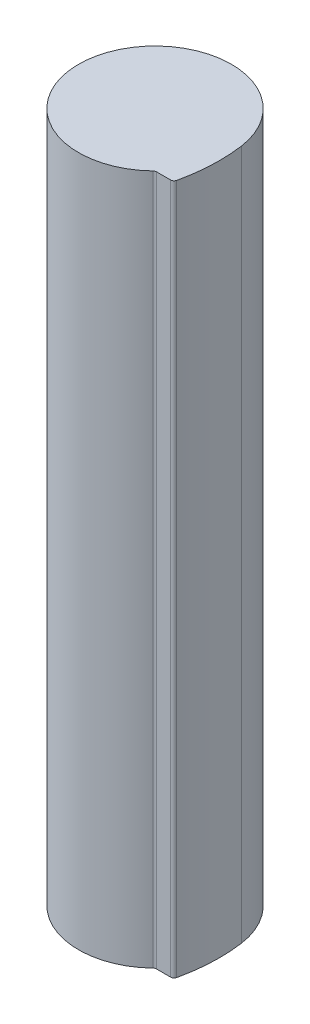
ISO-10303-21;
HEADER;
FILE_DESCRIPTION(('STEP AP214'),'2;1');
FILE_NAME('part.step','',(''),(''),'','','');
FILE_SCHEMA(('AUTOMOTIVE_DESIGN { 1 0 10303 214 1 1 1 1 }'));
ENDSEC;
DATA;
#1=APPLICATION_CONTEXT('core data for automotive mechanical design processes');
#2=APPLICATION_PROTOCOL_DEFINITION('international standard','automotive_design',2000,#1);
#3=PRODUCT_CONTEXT('',#1,'mechanical');
#4=PRODUCT('Part','Part','',(#3));
#5=PRODUCT_RELATED_PRODUCT_CATEGORY('part','',(#4));
#6=PRODUCT_DEFINITION_FORMATION('','',#4);
#7=PRODUCT_DEFINITION_CONTEXT('part definition',#1,'design');
#8=PRODUCT_DEFINITION('design','',#6,#7);
#9=PRODUCT_DEFINITION_SHAPE('','',#8);
#10=(LENGTH_UNIT() NAMED_UNIT(*) SI_UNIT(.MILLI.,.METRE.));
#11=(NAMED_UNIT(*) PLANE_ANGLE_UNIT() SI_UNIT($,.RADIAN.));
#12=(NAMED_UNIT(*) SI_UNIT($,.STERADIAN.) SOLID_ANGLE_UNIT());
#13=UNCERTAINTY_MEASURE_WITH_UNIT(LENGTH_MEASURE(1.E-05),#10,'distance_accuracy_value','');
#14=(GEOMETRIC_REPRESENTATION_CONTEXT(3) GLOBAL_UNCERTAINTY_ASSIGNED_CONTEXT((#13)) GLOBAL_UNIT_ASSIGNED_CONTEXT((#10,
#11,#12)) REPRESENTATION_CONTEXT('',''));
#15=CARTESIAN_POINT('',(0.,0.,0.));
#16=DIRECTION('',(0.,0.,1.));
#17=DIRECTION('',(1.,0.,0.));
#18=AXIS2_PLACEMENT_3D('',#15,#16,#17);
#19=CARTESIAN_POINT('',(0.,60.,0.));
#20=DIRECTION('',(0.,-1.,0.));
#21=DIRECTION('',(0.,0.,-1.));
#22=AXIS2_PLACEMENT_3D('',#19,#20,#21);
#23=CYLINDRICAL_SURFACE('',#22,6.65);
#24=CARTESIAN_POINT('',(0.,0.,0.));
#25=DIRECTION('',(0.,1.,0.));
#26=DIRECTION('',(0.,0.,1.));
#27=AXIS2_PLACEMENT_3D('',#24,#25,#26);
#28=CIRCLE('',#27,6.65);
#29=CARTESIAN_POINT('',(6.58730229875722,0.,-0.911015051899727));
#30=VERTEX_POINT('',#29);
#31=CARTESIAN_POINT('',(4.61441213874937,0.,4.78849669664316));
#32=VERTEX_POINT('',#31);
#33=EDGE_CURVE('E119',#30,#32,#28,.T.);
#34=ORIENTED_EDGE('',*,*,#33,.T.);
#35=DIRECTION('',(0.,-1.,0.));
#36=VECTOR('',#35,1.);
#37=CARTESIAN_POINT('',(4.61441213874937,60.,4.78849669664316));
#38=LINE('',#37,#36);
#39=CARTESIAN_POINT('',(4.61441213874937,60.,4.78849669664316));
#40=VERTEX_POINT('',#39);
#41=EDGE_CURVE('E55',#32,#40,#38,.F.);
#42=ORIENTED_EDGE('',*,*,#41,.T.);
#43=CARTESIAN_POINT('',(0.,60.,0.));
#44=DIRECTION('',(0.,1.,0.));
#45=DIRECTION('',(0.,0.,1.));
#46=AXIS2_PLACEMENT_3D('',#43,#44,#45);
#47=CIRCLE('',#46,6.65);
#48=CARTESIAN_POINT('',(6.58730229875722,60.,-0.911015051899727));
#49=VERTEX_POINT('',#48);
#50=EDGE_CURVE('E92',#49,#40,#47,.T.);
#51=ORIENTED_EDGE('',*,*,#50,.F.);
#52=DIRECTION('',(0.,-1.,0.));
#53=VECTOR('',#52,1.);
#54=CARTESIAN_POINT('',(6.58730229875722,60.,-0.911015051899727));
#55=LINE('',#54,#53);
#56=EDGE_CURVE('E100',#49,#30,#55,.T.);
#57=ORIENTED_EDGE('',*,*,#56,.T.);
#58=EDGE_LOOP('',(#34,#42,#51,#57));
#59=FACE_BOUND('',#58,.T.);
#60=ADVANCED_FACE('F39',(#59),#23,.T.);
#61=CARTESIAN_POINT('',(4.7,60.,4.70451910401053));
#62=DIRECTION('',(0.,0.,-1.));
#63=DIRECTION('',(-1.,0.,0.));
#64=AXIS2_PLACEMENT_3D('',#61,#62,#63);
#65=PLANE('',#64);
#66=DIRECTION('',(1.,0.,0.));
#67=VECTOR('',#66,1.);
#68=CARTESIAN_POINT('',(4.7,0.,4.70451910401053));
#69=LINE('',#68,#67);
#70=CARTESIAN_POINT('',(4.82258110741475,0.,4.70451910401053));
#71=VERTEX_POINT('',#70);
#72=CARTESIAN_POINT('',(6.06254593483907,0.,4.70451910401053));
#73=VERTEX_POINT('',#72);
#74=EDGE_CURVE('E116',#71,#73,#69,.T.);
#75=ORIENTED_EDGE('',*,*,#74,.T.);
#76=DIRECTION('',(0.,-1.,0.));
#77=VECTOR('',#76,1.);
#78=CARTESIAN_POINT('',(6.06254593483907,60.,4.70451910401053));
#79=LINE('',#78,#77);
#80=CARTESIAN_POINT('',(6.06254593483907,60.,4.70451910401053));
#81=VERTEX_POINT('',#80);
#82=EDGE_CURVE('E63',#73,#81,#79,.F.);
#83=ORIENTED_EDGE('',*,*,#82,.T.);
#84=DIRECTION('',(1.,0.,0.));
#85=VECTOR('',#84,1.);
#86=CARTESIAN_POINT('',(4.7,60.,4.70451910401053));
#87=LINE('',#86,#85);
#88=CARTESIAN_POINT('',(4.82258110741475,60.,4.70451910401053));
#89=VERTEX_POINT('',#88);
#90=EDGE_CURVE('E101',#89,#81,#87,.T.);
#91=ORIENTED_EDGE('',*,*,#90,.F.);
#92=DIRECTION('',(0.,1.,0.));
#93=VECTOR('',#92,1.);
#94=CARTESIAN_POINT('',(4.82258110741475,0.,4.70451910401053));
#95=LINE('',#94,#93);
#96=EDGE_CURVE('E129',#89,#71,#95,.F.);
#97=ORIENTED_EDGE('',*,*,#96,.T.);
#98=EDGE_LOOP('',(#75,#83,#91,#97));
#99=FACE_BOUND('',#98,.T.);
#100=ADVANCED_FACE('F144',(#99),#65,.F.);
#101=CARTESIAN_POINT('',(-8.27127431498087,60.,1.14390611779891));
#102=DIRECTION('',(0.,-1.,0.));
#103=DIRECTION('',(0.,0.,-1.));
#104=AXIS2_PLACEMENT_3D('',#101,#102,#103);
#105=CYLINDRICAL_SURFACE('',#104,15.);
#106=CARTESIAN_POINT('',(-8.27127431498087,60.,1.14390611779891));
#107=DIRECTION('',(0.,1.,0.));
#108=DIRECTION('',(0.,0.,1.));
#109=AXIS2_PLACEMENT_3D('',#106,#107,#108);
#110=CIRCLE('',#109,15.);
#111=CARTESIAN_POINT('',(6.35507287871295,60.,4.47106222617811));
#112=VERTEX_POINT('',#111);
#113=EDGE_CURVE('E89',#112,#49,#110,.T.);
#114=ORIENTED_EDGE('',*,*,#113,.F.);
#115=DIRECTION('',(0.,-1.,0.));
#116=VECTOR('',#115,1.);
#117=CARTESIAN_POINT('',(6.35507287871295,60.,4.47106222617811));
#118=LINE('',#117,#116);
#119=CARTESIAN_POINT('',(6.35507287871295,0.,4.47106222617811));
#120=VERTEX_POINT('',#119);
#121=EDGE_CURVE('E109',#112,#120,#118,.T.);
#122=ORIENTED_EDGE('',*,*,#121,.T.);
#123=CARTESIAN_POINT('',(-8.27127431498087,0.,1.14390611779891));
#124=DIRECTION('',(0.,1.,0.));
#125=DIRECTION('',(0.,0.,1.));
#126=AXIS2_PLACEMENT_3D('',#123,#124,#125);
#127=CIRCLE('',#126,15.);
#128=EDGE_CURVE('E106',#120,#30,#127,.T.);
#129=ORIENTED_EDGE('',*,*,#128,.T.);
#130=ORIENTED_EDGE('',*,*,#56,.F.);
#131=EDGE_LOOP('',(#114,#122,#129,#130));
#132=FACE_BOUND('',#131,.T.);
#133=ADVANCED_FACE('F104',(#132),#105,.T.);
#134=CARTESIAN_POINT('',(0.,60.,0.));
#135=DIRECTION('',(0.,1.,0.));
#136=DIRECTION('',(0.,0.,1.));
#137=AXIS2_PLACEMENT_3D('',#134,#135,#136);
#138=PLANE('',#137);
#139=ORIENTED_EDGE('',*,*,#90,.T.);
#140=CARTESIAN_POINT('',(6.06254593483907,60.,4.40451910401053));
#141=DIRECTION('',(0.,1.,0.));
#142=DIRECTION('',(0.,0.,1.));
#143=AXIS2_PLACEMENT_3D('',#140,#141,#142);
#144=CIRCLE('',#143,0.3);
#145=EDGE_CURVE('E95',#81,#112,#144,.T.);
#146=ORIENTED_EDGE('',*,*,#145,.T.);
#147=ORIENTED_EDGE('',*,*,#113,.T.);
#148=ORIENTED_EDGE('',*,*,#50,.T.);
#149=CARTESIAN_POINT('',(4.82258110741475,60.,5.00451910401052));
#150=DIRECTION('',(0.,1.,0.));
#151=DIRECTION('',(0.,0.,1.));
#152=AXIS2_PLACEMENT_3D('',#149,#150,#151);
#153=CIRCLE('',#152,0.3);
#154=EDGE_CURVE('E11',#40,#89,#153,.F.);
#155=ORIENTED_EDGE('',*,*,#154,.T.);
#156=EDGE_LOOP('',(#139,#146,#147,#148,#155));
#157=FACE_BOUND('',#156,.T.);
#158=ADVANCED_FACE('F91',(#157),#138,.T.);
#159=CARTESIAN_POINT('',(0.,0.,0.));
#160=DIRECTION('',(0.,1.,0.));
#161=DIRECTION('',(0.,0.,1.));
#162=AXIS2_PLACEMENT_3D('',#159,#160,#161);
#163=PLANE('',#162);
#164=ORIENTED_EDGE('',*,*,#128,.F.);
#165=CARTESIAN_POINT('',(6.06254593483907,0.,4.40451910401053));
#166=DIRECTION('',(0.,1.,0.));
#167=DIRECTION('',(0.,0.,1.));
#168=AXIS2_PLACEMENT_3D('',#165,#166,#167);
#169=CIRCLE('',#168,0.3);
#170=EDGE_CURVE('E126',#120,#73,#169,.F.);
#171=ORIENTED_EDGE('',*,*,#170,.T.);
#172=ORIENTED_EDGE('',*,*,#74,.F.);
#173=CARTESIAN_POINT('',(4.82258110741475,0.,5.00451910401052));
#174=DIRECTION('',(0.,1.,0.));
#175=DIRECTION('',(0.,0.,1.));
#176=AXIS2_PLACEMENT_3D('',#173,#174,#175);
#177=CIRCLE('',#176,0.3);
#178=EDGE_CURVE('E48',#71,#32,#177,.T.);
#179=ORIENTED_EDGE('',*,*,#178,.T.);
#180=ORIENTED_EDGE('',*,*,#33,.F.);
#181=EDGE_LOOP('',(#164,#171,#172,#179,#180));
#182=FACE_BOUND('',#181,.T.);
#183=ADVANCED_FACE('F141',(#182),#163,.F.);
#184=CARTESIAN_POINT('',(6.06254593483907,60.,4.40451910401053));
#185=DIRECTION('',(0.,-1.,0.));
#186=DIRECTION('',(0.,0.,-1.));
#187=AXIS2_PLACEMENT_3D('',#184,#185,#186);
#188=CYLINDRICAL_SURFACE('',#187,0.3);
#189=ORIENTED_EDGE('',*,*,#145,.F.);
#190=ORIENTED_EDGE('',*,*,#82,.F.);
#191=ORIENTED_EDGE('',*,*,#170,.F.);
#192=ORIENTED_EDGE('',*,*,#121,.F.);
#193=EDGE_LOOP('',(#189,#190,#191,#192));
#194=FACE_BOUND('',#193,.T.);
#195=ADVANCED_FACE('F146',(#194),#188,.T.);
#196=CARTESIAN_POINT('',(4.82258110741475,60.,5.00451910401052));
#197=DIRECTION('',(0.,-1.,0.));
#198=DIRECTION('',(0.,0.,-1.));
#199=AXIS2_PLACEMENT_3D('',#196,#197,#198);
#200=CYLINDRICAL_SURFACE('',#199,0.3);
#201=ORIENTED_EDGE('',*,*,#154,.F.);
#202=ORIENTED_EDGE('',*,*,#41,.F.);
#203=ORIENTED_EDGE('',*,*,#178,.F.);
#204=ORIENTED_EDGE('',*,*,#96,.F.);
#205=EDGE_LOOP('',(#201,#202,#203,#204));
#206=FACE_BOUND('',#205,.T.);
#207=ADVANCED_FACE('F41',(#206),#200,.F.);
#208=CLOSED_SHELL('',(#60,#100,#133,#158,#183,#195,#207));
#209=MANIFOLD_SOLID_BREP('B2',#208);
#210=ADVANCED_BREP_SHAPE_REPRESENTATION('',(#18,#209),#14);
#211=SHAPE_DEFINITION_REPRESENTATION(#9,#210);
ENDSEC;
END-ISO-10303-21;
